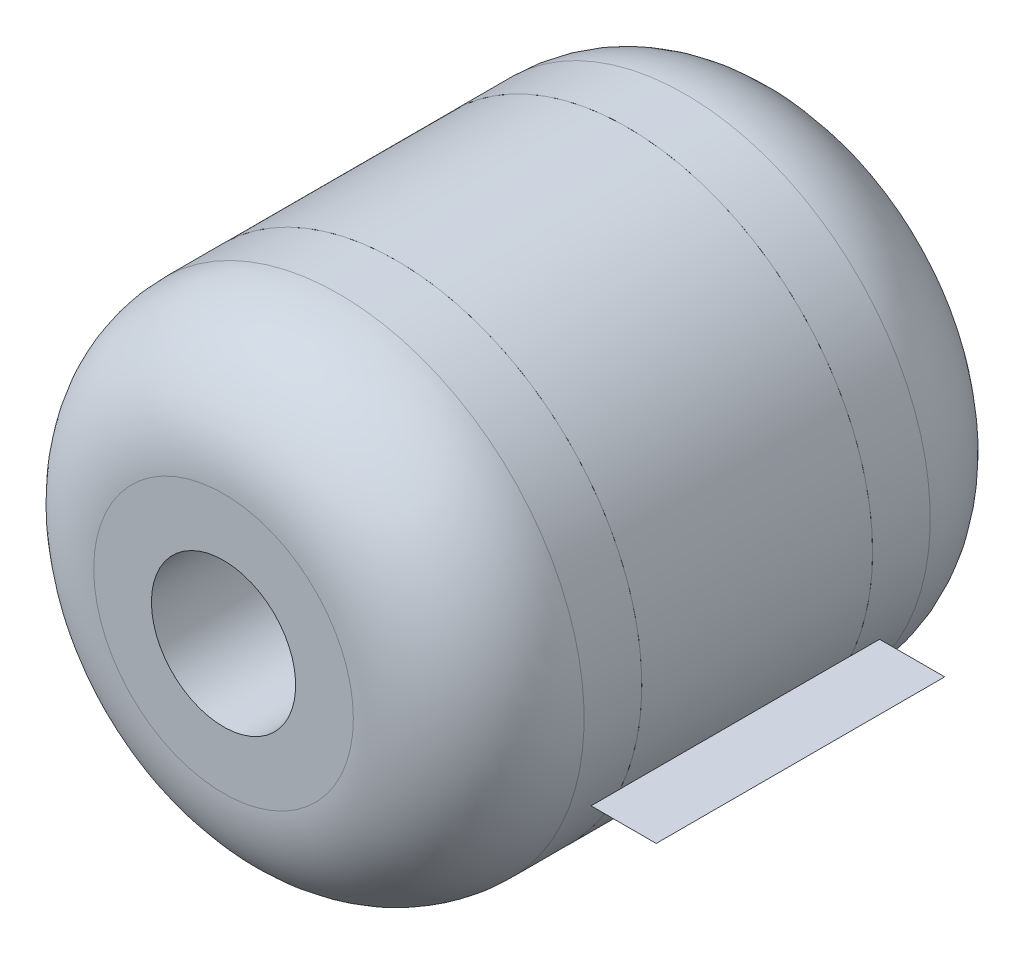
from build123d import *

# Parameters (mm, degrees)
ESQUISSE10_R       = 0.85
ESQUISSE10_R_2     = 0.25
BOSS_EXTRU_3_DEPTH = 0.4
ESQUISSE11_R       = 0.85
ESQUISSE11_R_2     = 0.25
BOSS_EXTRU_4_DEPTH = 0.6
CONG_5_R           = 0.4


with BuildPart() as part:
    # Esquisse10 → Boss.-Extru.3 (new, symmetric)
    with BuildSketch(Plane.XY):
        Circle(ESQUISSE10_R)
        Circle(ESQUISSE10_R_2, mode=Mode.SUBTRACT)
    extrude(amount=BOSS_EXTRU_3_DEPTH, both=True)


with BuildPart() as body_2:
    # Esquisse11 → Boss.-Extru.4 (new body)
    with BuildSketch(Plane(origin=(0, 0, -0.4), x_dir=(-1, 0, 0), z_dir=(0, 0, -1))):
        Circle(ESQUISSE11_R)
        Circle(ESQUISSE11_R_2, mode=Mode.SUBTRACT)
    extrude(amount=BOSS_EXTRU_4_DEPTH)

    # Cong_5
    cong_5_edges = [body_2.edges().sort_by_distance(p)[0] for p in [
        (0.85, 0, -1),
    ]]
    fillet(cong_5_edges, radius=CONG_5_R)


with BuildPart() as body_3:
    # Sym_trie1: mirrored copy
    add(body_2.part.mirror(Plane.XY))


solid = Compound([part.part, body_2.part, body_3.part])
